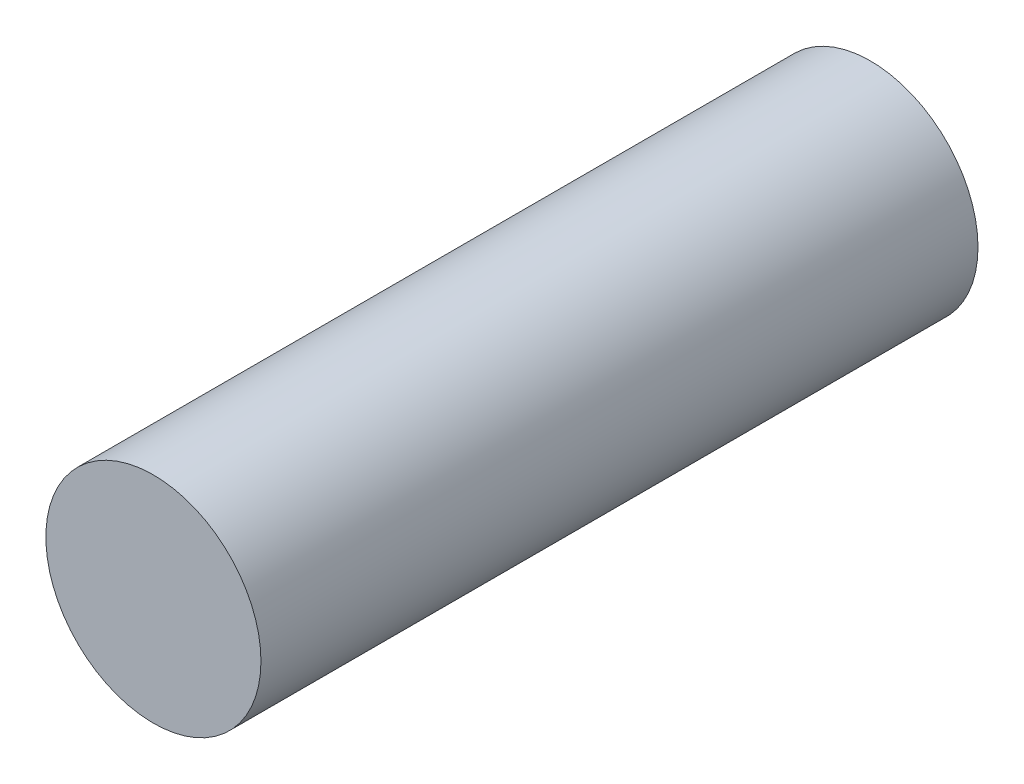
ISO-10303-21;
HEADER;
FILE_DESCRIPTION(('STEP AP214'),'2;1');
FILE_NAME('part.step','',(''),(''),'','','');
FILE_SCHEMA(('AUTOMOTIVE_DESIGN { 1 0 10303 214 1 1 1 1 }'));
ENDSEC;
DATA;
#1=APPLICATION_CONTEXT('core data for automotive mechanical design processes');
#2=APPLICATION_PROTOCOL_DEFINITION('international standard','automotive_design',2000,#1);
#3=PRODUCT_CONTEXT('',#1,'mechanical');
#4=PRODUCT('Part','Part','',(#3));
#5=PRODUCT_RELATED_PRODUCT_CATEGORY('part','',(#4));
#6=PRODUCT_DEFINITION_FORMATION('','',#4);
#7=PRODUCT_DEFINITION_CONTEXT('part definition',#1,'design');
#8=PRODUCT_DEFINITION('design','',#6,#7);
#9=PRODUCT_DEFINITION_SHAPE('','',#8);
#10=(LENGTH_UNIT() NAMED_UNIT(*) SI_UNIT(.MILLI.,.METRE.));
#11=(NAMED_UNIT(*) PLANE_ANGLE_UNIT() SI_UNIT($,.RADIAN.));
#12=(NAMED_UNIT(*) SI_UNIT($,.STERADIAN.) SOLID_ANGLE_UNIT());
#13=UNCERTAINTY_MEASURE_WITH_UNIT(LENGTH_MEASURE(1.E-05),#10,'distance_accuracy_value','');
#14=(GEOMETRIC_REPRESENTATION_CONTEXT(3) GLOBAL_UNCERTAINTY_ASSIGNED_CONTEXT((#13)) GLOBAL_UNIT_ASSIGNED_CONTEXT((#10,
#11,#12)) REPRESENTATION_CONTEXT('',''));
#15=CARTESIAN_POINT('',(0.,0.,0.));
#16=DIRECTION('',(0.,0.,1.));
#17=DIRECTION('',(1.,0.,0.));
#18=AXIS2_PLACEMENT_3D('',#15,#16,#17);
#19=CARTESIAN_POINT('',(0.,0.,10.));
#20=DIRECTION('',(0.,0.,-1.));
#21=DIRECTION('',(-1.,0.,0.));
#22=AXIS2_PLACEMENT_3D('',#19,#20,#21);
#23=CYLINDRICAL_SURFACE('',#22,1.5);
#24=CARTESIAN_POINT('',(0.,0.,10.));
#25=DIRECTION('',(0.,0.,1.));
#26=DIRECTION('',(1.,0.,0.));
#27=AXIS2_PLACEMENT_3D('',#24,#25,#26);
#28=CIRCLE('',#27,1.5);
#29=CARTESIAN_POINT('',(1.5,0.,10.));
#30=VERTEX_POINT('',#29);
#31=EDGE_CURVE('E10',#30,#30,#28,.T.);
#32=ORIENTED_EDGE('',*,*,#31,.F.);
#33=EDGE_LOOP('',(#32));
#34=FACE_BOUND('',#33,.T.);
#35=CARTESIAN_POINT('',(0.,0.,0.));
#36=DIRECTION('',(0.,0.,1.));
#37=DIRECTION('',(1.,0.,0.));
#38=AXIS2_PLACEMENT_3D('',#35,#36,#37);
#39=CIRCLE('',#38,1.5);
#40=CARTESIAN_POINT('',(1.5,0.,0.));
#41=VERTEX_POINT('',#40);
#42=EDGE_CURVE('E33',#41,#41,#39,.T.);
#43=ORIENTED_EDGE('',*,*,#42,.T.);
#44=EDGE_LOOP('',(#43));
#45=FACE_BOUND('',#44,.T.);
#46=ADVANCED_FACE('F30',(#34,#45),#23,.T.);
#47=CARTESIAN_POINT('',(0.,0.,10.));
#48=DIRECTION('',(0.,0.,1.));
#49=DIRECTION('',(1.,0.,0.));
#50=AXIS2_PLACEMENT_3D('',#47,#48,#49);
#51=PLANE('',#50);
#52=ORIENTED_EDGE('',*,*,#31,.T.);
#53=EDGE_LOOP('',(#52));
#54=FACE_BOUND('',#53,.T.);
#55=ADVANCED_FACE('F45',(#54),#51,.T.);
#56=CARTESIAN_POINT('',(0.,0.,0.));
#57=DIRECTION('',(0.,0.,1.));
#58=DIRECTION('',(1.,0.,0.));
#59=AXIS2_PLACEMENT_3D('',#56,#57,#58);
#60=PLANE('',#59);
#61=ORIENTED_EDGE('',*,*,#42,.F.);
#62=EDGE_LOOP('',(#61));
#63=FACE_BOUND('',#62,.T.);
#64=ADVANCED_FACE('F43',(#63),#60,.F.);
#65=CLOSED_SHELL('',(#46,#55,#64));
#66=MANIFOLD_SOLID_BREP('B2',#65);
#67=ADVANCED_BREP_SHAPE_REPRESENTATION('',(#18,#66),#14);
#68=SHAPE_DEFINITION_REPRESENTATION(#9,#67);
ENDSEC;
END-ISO-10303-21;
